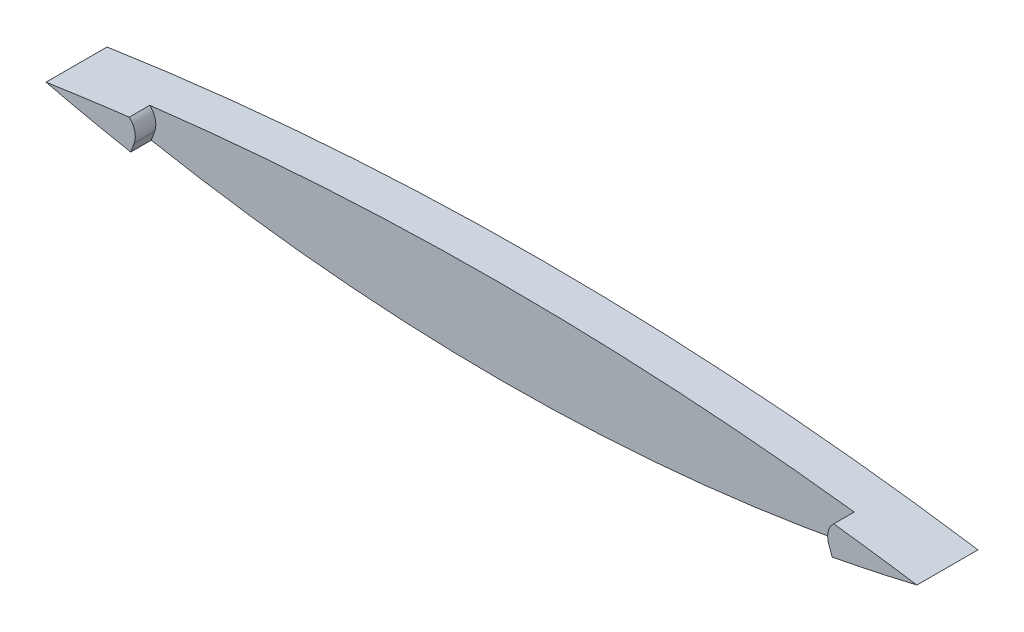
from build123d import *

# Parameters (mm, degrees)
EXTRUDE1_DEPTH = 1.08605
EXTRUDE2_START = 1.1
EXTRUDE2_DEPTH = 1.1


with BuildPart() as part:
    # Sketch1 → Extrude1 (new, symmetric)
    with BuildSketch(Plane.XY):
        with BuildLine():
            ThreePointArc((-23.353653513, 0), (0, -2.745854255), (23.353653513, 0))
            ThreePointArc((23.353653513, 0), (0, 1.754815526), (-23.353653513, 0))
        make_face()
    extrude(amount=EXTRUDE1_DEPTH, both=True)

    # Sketch5 → Extrude2 (add)
    with BuildSketch(Plane.XY.offset(1.08605).offset(EXTRUDE2_START)):
        with BuildLine():
            Line((-18.808257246, -0.973536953), (-18.625008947, -0.47006639))
            ThreePointArc((-18.625008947, -0.47006639), (-18.593331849, 0.109526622), (-18.888939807, 0.609073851))
            ThreePointArc((-18.888939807, 0.609073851), (-21.123492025, 0.320629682), (-23.353653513, 0))
            ThreePointArc((-23.353653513, 0), (-21.086574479, -0.513003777), (-18.808257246, -0.973536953))
        make_face()
        with BuildLine():
            Line((18.808257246, -0.973536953), (18.625008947, -0.47006639))
            ThreePointArc((18.625008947, -0.47006639), (18.593331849, 0.109526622), (18.888939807, 0.609073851))
            ThreePointArc((18.888939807, 0.609073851), (21.123492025, 0.320629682), (23.353653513, 0))
            ThreePointArc((23.353653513, 0), (21.086574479, -0.513003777), (18.808257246, -0.973536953))
        make_face()
    extrude(amount=-EXTRUDE2_DEPTH)


solid = part.part
